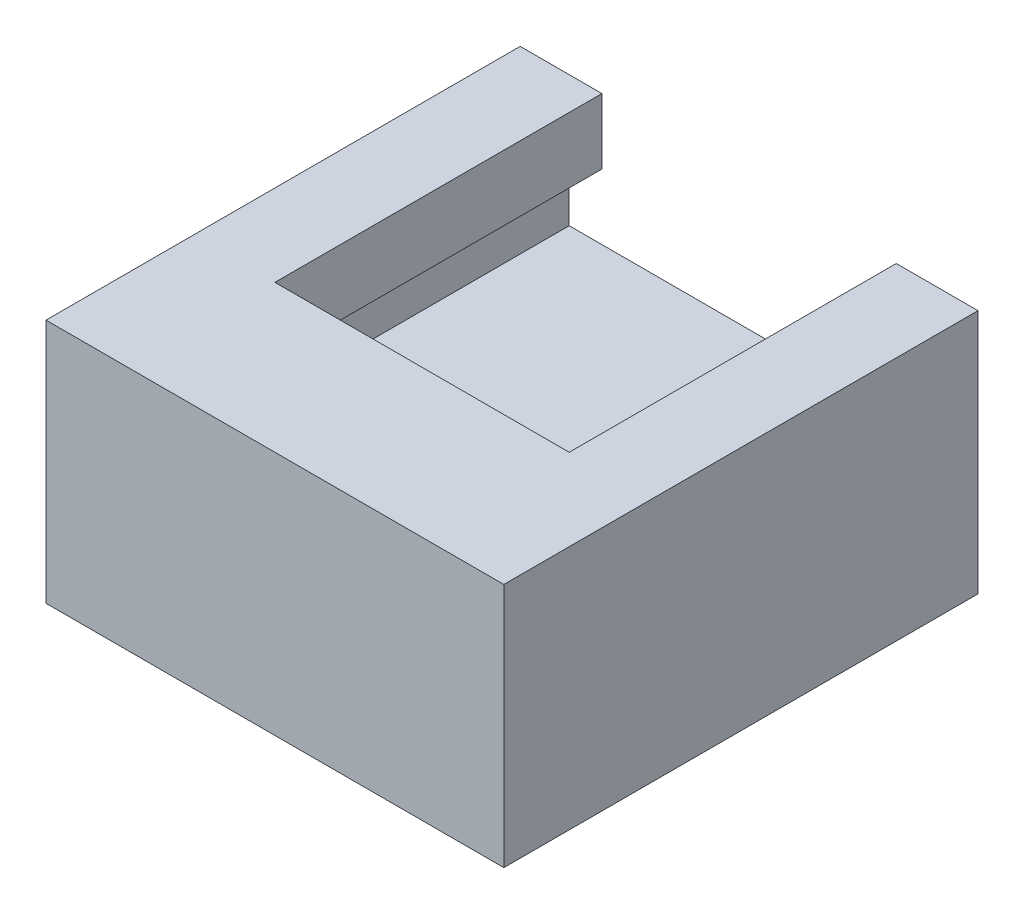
from build123d import *

# Parameters (mm, degrees)
SKETCH6_W           = 14
SKETCH6_H           = 10
BOSS_EXTRUDE4_DEPTH = 3.5
BOSS_EXTRUDE5_DEPTH = 10
SKETCH8_W           = 14
SKETCH8_H           = 7.5
BOSS_EXTRUDE6_DEPTH = 4.5


with BuildPart() as part:
    # Sketch6 → Boss-Extrude4 (new body)
    with BuildSketch(Plane(origin=(0, 0, 0), x_dir=(1, 0, 0), z_dir=(0, 1, 0))):
        with Locations((7, 5)):
            Rectangle(SKETCH6_W, SKETCH6_H)
    extrude(amount=BOSS_EXTRUDE4_DEPTH)

    # Sketch7 → Boss-Extrude5 (add)
    with BuildSketch(Plane.XY):
        Polygon((0, 3.5), (0, 7.5), (2.5, 7.5), (2.5, 5.5), (2, 5.5), (1.5, 5), (1.5, 3.5), align=None)
        Polygon((12.5, 5), (12.5, 3.5), (14, 3.5), (14, 7.5), (11.5, 7.5), (11.5, 5.5), (12, 5.5), align=None)
    extrude(amount=-BOSS_EXTRUDE5_DEPTH)

    # Sketch8 → Boss-Extrude6 (add)
    with BuildSketch(Plane.XY):
        with Locations((7, 3.75)):
            Rectangle(SKETCH8_W, SKETCH8_H)
    extrude(amount=BOSS_EXTRUDE6_DEPTH)


solid = part.part
